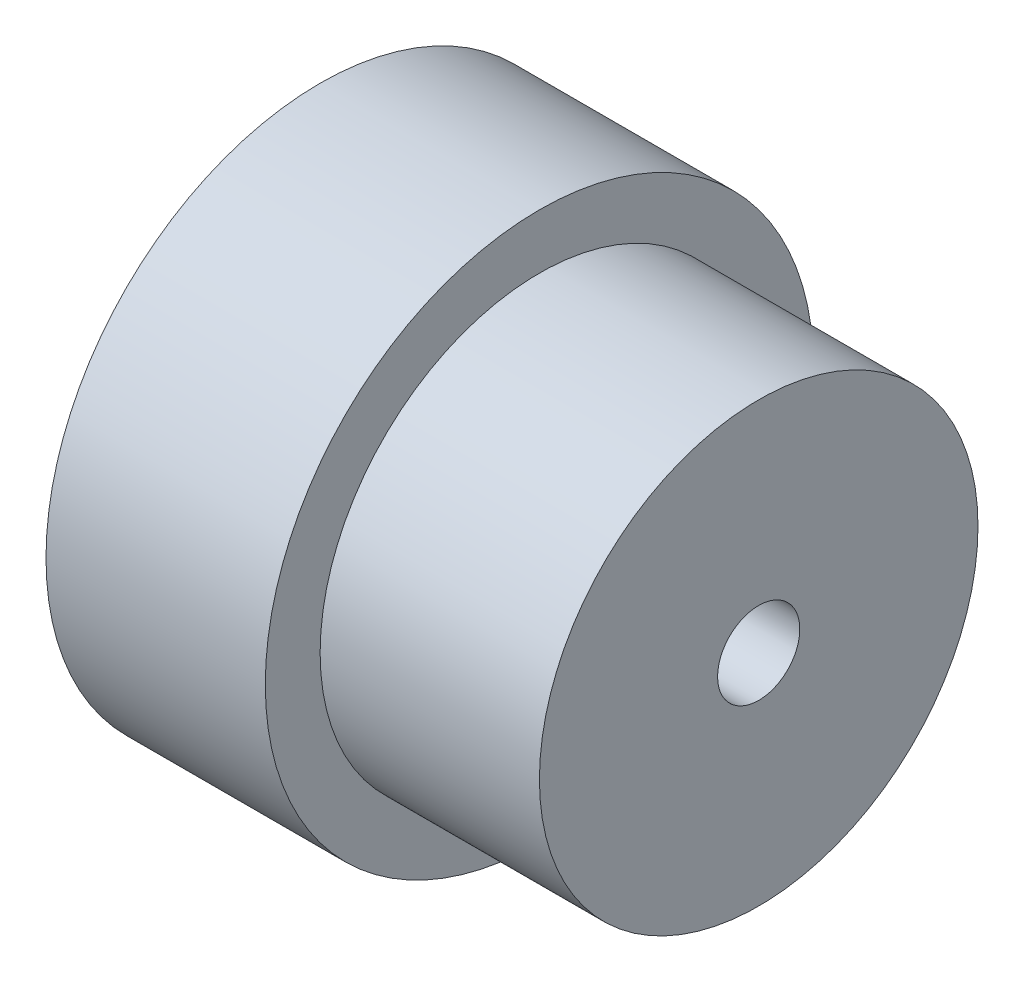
ISO-10303-21;
HEADER;
FILE_DESCRIPTION(('STEP AP214'),'2;1');
FILE_NAME('part.step','',(''),(''),'','','');
FILE_SCHEMA(('AUTOMOTIVE_DESIGN { 1 0 10303 214 1 1 1 1 }'));
ENDSEC;
DATA;
#1=APPLICATION_CONTEXT('core data for automotive mechanical design processes');
#2=APPLICATION_PROTOCOL_DEFINITION('international standard','automotive_design',2000,#1);
#3=PRODUCT_CONTEXT('',#1,'mechanical');
#4=PRODUCT('Part','Part','',(#3));
#5=PRODUCT_RELATED_PRODUCT_CATEGORY('part','',(#4));
#6=PRODUCT_DEFINITION_FORMATION('','',#4);
#7=PRODUCT_DEFINITION_CONTEXT('part definition',#1,'design');
#8=PRODUCT_DEFINITION('design','',#6,#7);
#9=PRODUCT_DEFINITION_SHAPE('','',#8);
#10=(LENGTH_UNIT() NAMED_UNIT(*) SI_UNIT(.MILLI.,.METRE.));
#11=(NAMED_UNIT(*) PLANE_ANGLE_UNIT() SI_UNIT($,.RADIAN.));
#12=(NAMED_UNIT(*) SI_UNIT($,.STERADIAN.) SOLID_ANGLE_UNIT());
#13=UNCERTAINTY_MEASURE_WITH_UNIT(LENGTH_MEASURE(1.E-05),#10,'distance_accuracy_value','');
#14=(GEOMETRIC_REPRESENTATION_CONTEXT(3) GLOBAL_UNCERTAINTY_ASSIGNED_CONTEXT((#13)) GLOBAL_UNIT_ASSIGNED_CONTEXT((#10,
#11,#12)) REPRESENTATION_CONTEXT('',''));
#15=CARTESIAN_POINT('',(0.,0.,0.));
#16=DIRECTION('',(0.,0.,1.));
#17=DIRECTION('',(1.,0.,0.));
#18=AXIS2_PLACEMENT_3D('',#15,#16,#17);
#19=CARTESIAN_POINT('',(13.6274169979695,8.88991235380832,-273.448739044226));
#20=DIRECTION('',(-1.,0.,0.));
#21=DIRECTION('',(0.,0.,1.));
#22=AXIS2_PLACEMENT_3D('',#19,#20,#21);
#23=CYLINDRICAL_SURFACE('',#22,7.99999999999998);
#24=CARTESIAN_POINT('',(-9.,8.88991235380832,-273.448739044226));
#25=DIRECTION('',(-1.,0.,0.));
#26=DIRECTION('',(0.,0.,1.));
#27=AXIS2_PLACEMENT_3D('',#24,#25,#26);
#28=CIRCLE('',#27,7.99999999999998);
#29=CARTESIAN_POINT('',(-9.,8.88991235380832,-265.448739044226));
#30=VERTEX_POINT('',#29);
#31=EDGE_CURVE('E10',#30,#30,#28,.F.);
#32=ORIENTED_EDGE('',*,*,#31,.F.);
#33=EDGE_LOOP('',(#32));
#34=FACE_BOUND('',#33,.T.);
#35=CARTESIAN_POINT('',(-17.,8.88991235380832,-273.448739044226));
#36=DIRECTION('',(-1.,0.,0.));
#37=DIRECTION('',(0.,0.,1.));
#38=AXIS2_PLACEMENT_3D('',#35,#36,#37);
#39=CIRCLE('',#38,7.99999999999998);
#40=CARTESIAN_POINT('',(-17.,8.88991235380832,-265.448739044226));
#41=VERTEX_POINT('',#40);
#42=EDGE_CURVE('E35',#41,#41,#39,.T.);
#43=ORIENTED_EDGE('',*,*,#42,.F.);
#44=EDGE_LOOP('',(#43));
#45=FACE_BOUND('',#44,.T.);
#46=ADVANCED_FACE('F29',(#34,#45),#23,.T.);
#47=CARTESIAN_POINT('',(-9.,0.,0.));
#48=DIRECTION('',(-1.,0.,0.));
#49=DIRECTION('',(0.,0.,1.));
#50=AXIS2_PLACEMENT_3D('',#47,#48,#49);
#51=PLANE('',#50);
#52=CARTESIAN_POINT('',(-8.99999999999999,8.88991235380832,-273.448739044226));
#53=DIRECTION('',(-1.,0.,0.));
#54=DIRECTION('',(0.,0.,1.));
#55=AXIS2_PLACEMENT_3D('',#52,#53,#54);
#56=CIRCLE('',#55,1.50000000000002);
#57=CARTESIAN_POINT('',(-8.99999999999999,8.88991235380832,-271.948739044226));
#58=VERTEX_POINT('',#57);
#59=EDGE_CURVE('E47',#58,#58,#56,.T.);
#60=ORIENTED_EDGE('',*,*,#59,.T.);
#61=EDGE_LOOP('',(#60));
#62=FACE_BOUND('',#61,.T.);
#63=ORIENTED_EDGE('',*,*,#31,.T.);
#64=EDGE_LOOP('',(#63));
#65=FACE_BOUND('',#64,.T.);
#66=ADVANCED_FACE('F68',(#62,#65),#51,.F.);
#67=CARTESIAN_POINT('',(-25.,8.88991235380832,-273.448739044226));
#68=DIRECTION('',(1.,0.,0.));
#69=DIRECTION('',(0.,0.,-1.));
#70=AXIS2_PLACEMENT_3D('',#67,#68,#69);
#71=CYLINDRICAL_SURFACE('',#70,9.99999999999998);
#72=CARTESIAN_POINT('',(-25.,8.88991235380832,-273.448739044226));
#73=DIRECTION('',(-1.,0.,0.));
#74=DIRECTION('',(0.,0.,1.));
#75=AXIS2_PLACEMENT_3D('',#72,#73,#74);
#76=CIRCLE('',#75,9.99999999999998);
#77=CARTESIAN_POINT('',(-25.,8.88991235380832,-263.448739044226));
#78=VERTEX_POINT('',#77);
#79=EDGE_CURVE('E39',#78,#78,#76,.T.);
#80=ORIENTED_EDGE('',*,*,#79,.F.);
#81=EDGE_LOOP('',(#80));
#82=FACE_BOUND('',#81,.T.);
#83=CARTESIAN_POINT('',(-17.,8.88991235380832,-273.448739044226));
#84=DIRECTION('',(-1.,0.,0.));
#85=DIRECTION('',(0.,0.,1.));
#86=AXIS2_PLACEMENT_3D('',#83,#84,#85);
#87=CIRCLE('',#86,9.99999999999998);
#88=CARTESIAN_POINT('',(-17.,8.88991235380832,-263.448739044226));
#89=VERTEX_POINT('',#88);
#90=EDGE_CURVE('E43',#89,#89,#87,.T.);
#91=ORIENTED_EDGE('',*,*,#90,.T.);
#92=EDGE_LOOP('',(#91));
#93=FACE_BOUND('',#92,.T.);
#94=ADVANCED_FACE('F62',(#82,#93),#71,.T.);
#95=CARTESIAN_POINT('',(-25.,8.88991235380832,-273.448739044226));
#96=DIRECTION('',(-1.,0.,0.));
#97=DIRECTION('',(0.,0.,1.));
#98=AXIS2_PLACEMENT_3D('',#95,#96,#97);
#99=PLANE('',#98);
#100=CARTESIAN_POINT('',(-25.,8.88991235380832,-273.448739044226));
#101=DIRECTION('',(-1.,0.,0.));
#102=DIRECTION('',(0.,0.,1.));
#103=AXIS2_PLACEMENT_3D('',#100,#101,#102);
#104=CIRCLE('',#103,1.50000000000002);
#105=CARTESIAN_POINT('',(-25.,8.88991235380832,-271.948739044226));
#106=VERTEX_POINT('',#105);
#107=EDGE_CURVE('E51',#106,#106,#104,.T.);
#108=ORIENTED_EDGE('',*,*,#107,.F.);
#109=EDGE_LOOP('',(#108));
#110=FACE_BOUND('',#109,.T.);
#111=ORIENTED_EDGE('',*,*,#79,.T.);
#112=EDGE_LOOP('',(#111));
#113=FACE_BOUND('',#112,.T.);
#114=ADVANCED_FACE('F58',(#110,#113),#99,.T.);
#115=CARTESIAN_POINT('',(-17.,8.88991235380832,-273.448739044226));
#116=DIRECTION('',(-1.,0.,0.));
#117=DIRECTION('',(0.,0.,1.));
#118=AXIS2_PLACEMENT_3D('',#115,#116,#117);
#119=PLANE('',#118);
#120=ORIENTED_EDGE('',*,*,#42,.T.);
#121=EDGE_LOOP('',(#120));
#122=FACE_BOUND('',#121,.T.);
#123=ORIENTED_EDGE('',*,*,#90,.F.);
#124=EDGE_LOOP('',(#123));
#125=FACE_BOUND('',#124,.T.);
#126=ADVANCED_FACE('F61',(#122,#125),#119,.F.);
#127=CARTESIAN_POINT('',(90.,8.88991235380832,-273.448739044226));
#128=DIRECTION('',(-1.,0.,0.));
#129=DIRECTION('',(0.,0.,1.));
#130=AXIS2_PLACEMENT_3D('',#127,#128,#129);
#131=CYLINDRICAL_SURFACE('',#130,1.50000000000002);
#132=ORIENTED_EDGE('',*,*,#107,.T.);
#133=EDGE_LOOP('',(#132));
#134=FACE_BOUND('',#133,.T.);
#135=ORIENTED_EDGE('',*,*,#59,.F.);
#136=EDGE_LOOP('',(#135));
#137=FACE_BOUND('',#136,.T.);
#138=ADVANCED_FACE('F55',(#134,#137),#131,.F.);
#139=CLOSED_SHELL('',(#46,#66,#94,#114,#126,#138));
#140=MANIFOLD_SOLID_BREP('B2',#139);
#141=ADVANCED_BREP_SHAPE_REPRESENTATION('',(#18,#140),#14);
#142=SHAPE_DEFINITION_REPRESENTATION(#9,#141);
ENDSEC;
END-ISO-10303-21;
